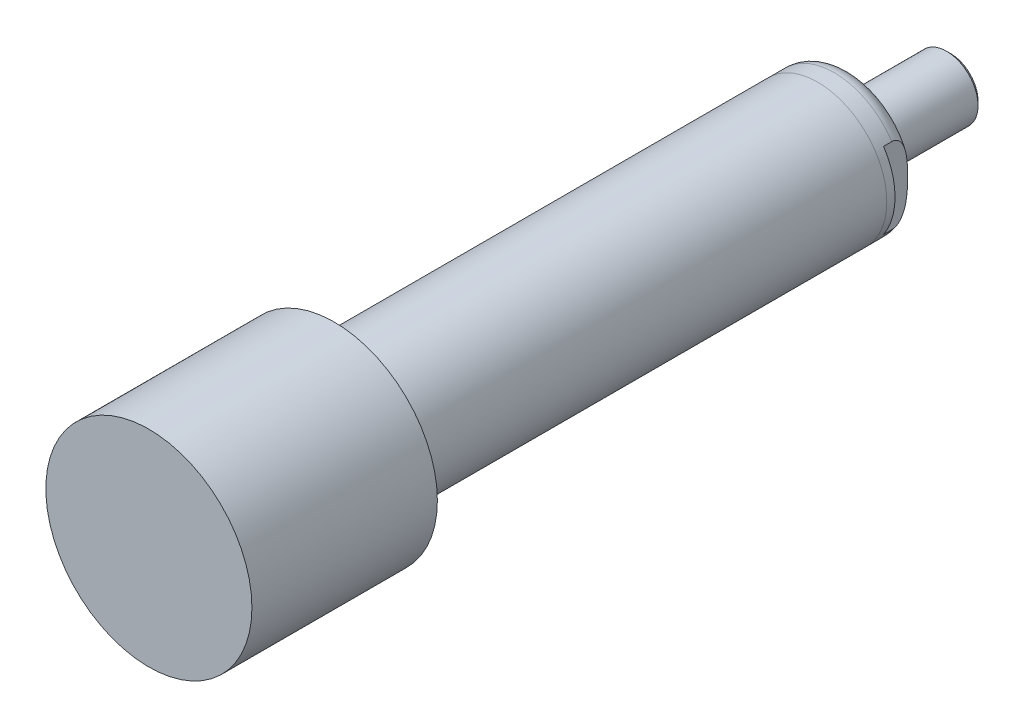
ISO-10303-21;
HEADER;
FILE_DESCRIPTION(('STEP AP214'),'2;1');
FILE_NAME('part.step','',(''),(''),'','','');
FILE_SCHEMA(('AUTOMOTIVE_DESIGN { 1 0 10303 214 1 1 1 1 }'));
ENDSEC;
DATA;
#1=APPLICATION_CONTEXT('core data for automotive mechanical design processes');
#2=APPLICATION_PROTOCOL_DEFINITION('international standard','automotive_design',2000,#1);
#3=PRODUCT_CONTEXT('',#1,'mechanical');
#4=PRODUCT('Part','Part','',(#3));
#5=PRODUCT_RELATED_PRODUCT_CATEGORY('part','',(#4));
#6=PRODUCT_DEFINITION_FORMATION('','',#4);
#7=PRODUCT_DEFINITION_CONTEXT('part definition',#1,'design');
#8=PRODUCT_DEFINITION('design','',#6,#7);
#9=PRODUCT_DEFINITION_SHAPE('','',#8);
#10=(LENGTH_UNIT() NAMED_UNIT(*) SI_UNIT(.MILLI.,.METRE.));
#11=(NAMED_UNIT(*) PLANE_ANGLE_UNIT() SI_UNIT($,.RADIAN.));
#12=(NAMED_UNIT(*) SI_UNIT($,.STERADIAN.) SOLID_ANGLE_UNIT());
#13=UNCERTAINTY_MEASURE_WITH_UNIT(LENGTH_MEASURE(1.E-05),#10,'distance_accuracy_value','');
#14=(GEOMETRIC_REPRESENTATION_CONTEXT(3) GLOBAL_UNCERTAINTY_ASSIGNED_CONTEXT((#13)) GLOBAL_UNIT_ASSIGNED_CONTEXT((#10,
#11,#12)) REPRESENTATION_CONTEXT('',''));
#15=CARTESIAN_POINT('',(0.,0.,0.));
#16=DIRECTION('',(0.,0.,1.));
#17=DIRECTION('',(1.,0.,0.));
#18=AXIS2_PLACEMENT_3D('',#15,#16,#17);
#19=CARTESIAN_POINT('',(0.,0.,12.7));
#20=DIRECTION('',(0.,0.,-1.));
#21=DIRECTION('',(-1.,0.,0.));
#22=AXIS2_PLACEMENT_3D('',#19,#20,#21);
#23=CYLINDRICAL_SURFACE('',#22,13.2);
#24=CARTESIAN_POINT('',(0.,0.,12.7));
#25=DIRECTION('',(0.,0.,1.));
#26=DIRECTION('',(1.,0.,0.));
#27=AXIS2_PLACEMENT_3D('',#24,#25,#26);
#28=CIRCLE('',#27,13.2);
#29=CARTESIAN_POINT('',(13.2,0.,12.7));
#30=VERTEX_POINT('',#29);
#31=EDGE_CURVE('E30',#30,#30,#28,.T.);
#32=ORIENTED_EDGE('',*,*,#31,.F.);
#33=EDGE_LOOP('',(#32));
#34=FACE_BOUND('',#33,.T.);
#35=CARTESIAN_POINT('',(0.,0.,-79.6352000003));
#36=DIRECTION('',(0.,0.,1.));
#37=DIRECTION('',(1.,0.,0.));
#38=AXIS2_PLACEMENT_3D('',#35,#36,#37);
#39=CIRCLE('',#38,13.2);
#40=CARTESIAN_POINT('',(13.2,0.,-79.6352000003));
#41=VERTEX_POINT('',#40);
#42=EDGE_CURVE('E197',#41,#41,#39,.T.);
#43=ORIENTED_EDGE('',*,*,#42,.T.);
#44=EDGE_LOOP('',(#43));
#45=FACE_BOUND('',#44,.T.);
#46=ADVANCED_FACE('F16',(#34,#45),#23,.T.);
#47=CARTESIAN_POINT('',(0.,0.,-79.6352000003));
#48=DIRECTION('',(0.,0.,1.));
#49=DIRECTION('',(1.,0.,0.));
#50=AXIS2_PLACEMENT_3D('',#47,#48,#49);
#51=PLANE('',#50);
#52=CARTESIAN_POINT('',(0.,0.,-79.6352000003));
#53=DIRECTION('',(0.,0.,1.));
#54=DIRECTION('',(1.,0.,0.));
#55=AXIS2_PLACEMENT_3D('',#52,#53,#54);
#56=CIRCLE('',#55,13.1953);
#57=CARTESIAN_POINT('',(13.1953,0.,-79.6352000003));
#58=VERTEX_POINT('',#57);
#59=EDGE_CURVE('E10',#58,#58,#56,.T.);
#60=ORIENTED_EDGE('',*,*,#59,.T.);
#61=EDGE_LOOP('',(#60));
#62=FACE_BOUND('',#61,.T.);
#63=ORIENTED_EDGE('',*,*,#42,.F.);
#64=EDGE_LOOP('',(#63));
#65=FACE_BOUND('',#64,.T.);
#66=ADVANCED_FACE('F129',(#62,#65),#51,.F.);
#67=CARTESIAN_POINT('',(0.,6.,-105.0352000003));
#68=DIRECTION('',(0.,0.,-1.));
#69=DIRECTION('',(-1.,0.,0.));
#70=AXIS2_PLACEMENT_3D('',#67,#68,#69);
#71=PLANE('',#70);
#72=CARTESIAN_POINT('',(0.,0.,-105.0352000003));
#73=DIRECTION('',(0.,0.,-1.));
#74=DIRECTION('',(-1.,0.,0.));
#75=AXIS2_PLACEMENT_3D('',#72,#73,#74);
#76=CIRCLE('',#75,5.238);
#77=CARTESIAN_POINT('',(-5.238,0.,-105.0352000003));
#78=VERTEX_POINT('',#77);
#79=EDGE_CURVE('E107',#78,#78,#76,.T.);
#80=ORIENTED_EDGE('',*,*,#79,.T.);
#81=EDGE_LOOP('',(#80));
#82=FACE_BOUND('',#81,.T.);
#83=ADVANCED_FACE('F126',(#82),#71,.T.);
#84=CARTESIAN_POINT('',(0.,0.,-105.0352000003));
#85=DIRECTION('',(0.,0.,1.));
#86=DIRECTION('',(1.,0.,0.));
#87=AXIS2_PLACEMENT_3D('',#84,#85,#86);
#88=CONICAL_SURFACE('',#87,5.238,0.785398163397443);
#89=CARTESIAN_POINT('',(0.,0.,-104.2732000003));
#90=DIRECTION('',(0.,0.,-1.));
#91=DIRECTION('',(-1.,0.,0.));
#92=AXIS2_PLACEMENT_3D('',#89,#90,#91);
#93=CIRCLE('',#92,6.);
#94=CARTESIAN_POINT('',(-6.,0.,-104.2732000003));
#95=VERTEX_POINT('',#94);
#96=EDGE_CURVE('E110',#95,#95,#93,.F.);
#97=ORIENTED_EDGE('',*,*,#96,.F.);
#98=EDGE_LOOP('',(#97));
#99=FACE_BOUND('',#98,.T.);
#100=ORIENTED_EDGE('',*,*,#79,.F.);
#101=EDGE_LOOP('',(#100));
#102=FACE_BOUND('',#101,.T.);
#103=ADVANCED_FACE('F18',(#99,#102),#88,.T.);
#104=CARTESIAN_POINT('',(0.,0.,-105.0352000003));
#105=DIRECTION('',(0.,0.,-1.));
#106=DIRECTION('',(-1.,0.,0.));
#107=AXIS2_PLACEMENT_3D('',#104,#105,#106);
#108=CYLINDRICAL_SURFACE('',#107,6.);
#109=ORIENTED_EDGE('',*,*,#96,.T.);
#110=EDGE_LOOP('',(#109));
#111=FACE_BOUND('',#110,.T.);
#112=CARTESIAN_POINT('',(0.,0.,-88.7792000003));
#113=DIRECTION('',(0.,0.,-1.));
#114=DIRECTION('',(-1.,0.,0.));
#115=AXIS2_PLACEMENT_3D('',#112,#113,#114);
#116=CIRCLE('',#115,6.);
#117=CARTESIAN_POINT('',(-6.,0.,-88.7792000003));
#118=VERTEX_POINT('',#117);
#119=EDGE_CURVE('E83',#118,#118,#116,.T.);
#120=ORIENTED_EDGE('',*,*,#119,.T.);
#121=EDGE_LOOP('',(#120));
#122=FACE_BOUND('',#121,.T.);
#123=ADVANCED_FACE('F131',(#111,#122),#108,.T.);
#124=CARTESIAN_POINT('',(0.,4.6736,-88.7792000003));
#125=DIRECTION('',(0.,0.,1.));
#126=DIRECTION('',(1.,0.,0.));
#127=AXIS2_PLACEMENT_3D('',#124,#125,#126);
#128=PLANE('',#127);
#129=CARTESIAN_POINT('',(0.,0.,-88.7792000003));
#130=DIRECTION('',(0.,0.,-1.));
#131=DIRECTION('',(-1.,0.,0.));
#132=AXIS2_PLACEMENT_3D('',#129,#130,#131);
#133=CIRCLE('',#132,4.6736);
#134=CARTESIAN_POINT('',(-4.6736,0.,-88.7792000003));
#135=VERTEX_POINT('',#134);
#136=EDGE_CURVE('E95',#135,#135,#133,.T.);
#137=ORIENTED_EDGE('',*,*,#136,.T.);
#138=EDGE_LOOP('',(#137));
#139=FACE_BOUND('',#138,.T.);
#140=ORIENTED_EDGE('',*,*,#119,.F.);
#141=EDGE_LOOP('',(#140));
#142=FACE_BOUND('',#141,.T.);
#143=ADVANCED_FACE('F134',(#139,#142),#128,.T.);
#144=CARTESIAN_POINT('',(0.,0.,-105.0352000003));
#145=DIRECTION('',(0.,0.,-1.));
#146=DIRECTION('',(-1.,0.,0.));
#147=AXIS2_PLACEMENT_3D('',#144,#145,#146);
#148=CYLINDRICAL_SURFACE('',#147,4.6736);
#149=CARTESIAN_POINT('',(0.,0.,-85.9852000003));
#150=DIRECTION('',(0.,0.,-1.));
#151=DIRECTION('',(-1.,0.,0.));
#152=AXIS2_PLACEMENT_3D('',#149,#150,#151);
#153=CIRCLE('',#152,4.6736);
#154=CARTESIAN_POINT('',(-4.6736,0.,-85.9852000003));
#155=VERTEX_POINT('',#154);
#156=EDGE_CURVE('E98',#155,#155,#153,.T.);
#157=ORIENTED_EDGE('',*,*,#156,.T.);
#158=EDGE_LOOP('',(#157));
#159=FACE_BOUND('',#158,.T.);
#160=ORIENTED_EDGE('',*,*,#136,.F.);
#161=EDGE_LOOP('',(#160));
#162=FACE_BOUND('',#161,.T.);
#163=ADVANCED_FACE('F138',(#159,#162),#148,.T.);
#164=CARTESIAN_POINT('',(0.,10.0203,-85.9852000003));
#165=DIRECTION('',(0.,0.,-1.));
#166=DIRECTION('',(-1.,0.,0.));
#167=AXIS2_PLACEMENT_3D('',#164,#165,#166);
#168=PLANE('',#167);
#169=CARTESIAN_POINT('',(0.,0.,-85.9852000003));
#170=DIRECTION('',(0.,0.,-1.));
#171=DIRECTION('',(-1.,0.,0.));
#172=AXIS2_PLACEMENT_3D('',#169,#170,#171);
#173=CIRCLE('',#172,10.0203);
#174=CARTESIAN_POINT('',(-10.0203,0.,-85.9852000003));
#175=VERTEX_POINT('',#174);
#176=EDGE_CURVE('E101',#175,#175,#173,.T.);
#177=ORIENTED_EDGE('',*,*,#176,.T.);
#178=EDGE_LOOP('',(#177));
#179=FACE_BOUND('',#178,.T.);
#180=ORIENTED_EDGE('',*,*,#156,.F.);
#181=EDGE_LOOP('',(#180));
#182=FACE_BOUND('',#181,.T.);
#183=ADVANCED_FACE('F141',(#179,#182),#168,.T.);
#184=CARTESIAN_POINT('',(0.,0.,-81.2227000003));
#185=DIRECTION('',(0.,0.,-1.));
#186=DIRECTION('',(0.,1.,0.));
#187=AXIS2_PLACEMENT_3D('',#184,#185,#186);
#188=PLANE('',#187);
#189=CARTESIAN_POINT('',(0.,0.,-81.2227000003));
#190=DIRECTION('',(0.,0.,-1.));
#191=DIRECTION('',(0.,1.,0.));
#192=AXIS2_PLACEMENT_3D('',#189,#190,#191);
#193=CIRCLE('',#192,13.1953);
#194=CARTESIAN_POINT('',(11.,7.28806847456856,-81.2227000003));
#195=VERTEX_POINT('',#194);
#196=CARTESIAN_POINT('',(11.,-7.28806847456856,-81.2227000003));
#197=VERTEX_POINT('',#196);
#198=EDGE_CURVE('E66',#195,#197,#193,.T.);
#199=ORIENTED_EDGE('',*,*,#198,.T.);
#200=DIRECTION('',(0.,1.,0.));
#201=VECTOR('',#200,1.);
#202=CARTESIAN_POINT('',(11.,-7.28806847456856,-81.2227000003));
#203=LINE('',#202,#201);
#204=EDGE_CURVE('E68',#197,#195,#203,.T.);
#205=ORIENTED_EDGE('',*,*,#204,.T.);
#206=EDGE_LOOP('',(#199,#205));
#207=FACE_BOUND('',#206,.T.);
#208=ADVANCED_FACE('F67',(#207),#188,.T.);
#209=CARTESIAN_POINT('',(0.,0.,-81.2227000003));
#210=DIRECTION('',(0.,0.,-1.));
#211=DIRECTION('',(0.,1.,0.));
#212=AXIS2_PLACEMENT_3D('',#209,#210,#211);
#213=PLANE('',#212);
#214=CARTESIAN_POINT('',(0.,0.,-81.2227000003));
#215=DIRECTION('',(0.,0.,-1.));
#216=DIRECTION('',(0.,1.,0.));
#217=AXIS2_PLACEMENT_3D('',#214,#215,#216);
#218=CIRCLE('',#217,13.1953);
#219=CARTESIAN_POINT('',(-11.,-7.28806847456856,-81.2227000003));
#220=VERTEX_POINT('',#219);
#221=CARTESIAN_POINT('',(-11.,7.28806847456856,-81.2227000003));
#222=VERTEX_POINT('',#221);
#223=EDGE_CURVE('E86',#220,#222,#218,.T.);
#224=ORIENTED_EDGE('',*,*,#223,.T.);
#225=DIRECTION('',(0.,-1.,0.));
#226=VECTOR('',#225,1.);
#227=CARTESIAN_POINT('',(-11.,-7.28806847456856,-81.2227000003));
#228=LINE('',#227,#226);
#229=EDGE_CURVE('E88',#222,#220,#228,.T.);
#230=ORIENTED_EDGE('',*,*,#229,.T.);
#231=EDGE_LOOP('',(#224,#230));
#232=FACE_BOUND('',#231,.T.);
#233=ADVANCED_FACE('F125',(#232),#213,.T.);
#234=CARTESIAN_POINT('',(-11.,-7.28806847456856,-81.2227000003));
#235=DIRECTION('',(1.,0.,0.));
#236=DIRECTION('',(0.,0.,-1.));
#237=AXIS2_PLACEMENT_3D('',#234,#235,#236);
#238=PLANE('',#237);
#239=CARTESIAN_POINT('',(-11.,0.,-85.8302683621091));
#240=CARTESIAN_POINT('',(-11.,-0.283999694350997,-85.8302768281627));
#241=CARTESIAN_POINT('',(-11.,-0.568005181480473,-85.8267628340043));
#242=CARTESIAN_POINT('',(-11.,-1.13588950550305,-85.8120026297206));
#243=CARTESIAN_POINT('',(-11.,-1.41976830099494,-85.8007547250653));
#244=CARTESIAN_POINT('',(-11.,-1.98660637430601,-85.7683601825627));
#245=CARTESIAN_POINT('',(-11.,-2.2695663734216,-85.7472267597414));
#246=CARTESIAN_POINT('',(-11.,-2.83413520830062,-85.6914556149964));
#247=CARTESIAN_POINT('',(-11.,-3.11574456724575,-85.6568236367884));
#248=CARTESIAN_POINT('',(-11.,-3.55465920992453,-85.5878840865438));
#249=CARTESIAN_POINT('',(-11.,-3.71295758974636,-85.5599370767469));
#250=CARTESIAN_POINT('',(-11.,-4.02809043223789,-85.4968007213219));
#251=CARTESIAN_POINT('',(-11.,-4.18492521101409,-85.46161297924));
#252=CARTESIAN_POINT('',(-11.,-4.49637441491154,-85.3826027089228));
#253=CARTESIAN_POINT('',(-11.,-4.65098969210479,-85.3387835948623));
#254=CARTESIAN_POINT('',(-11.,-4.95689533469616,-85.2408738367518));
#255=CARTESIAN_POINT('',(-11.,-5.10818706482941,-85.186787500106));
#256=CARTESIAN_POINT('',(-11.,-5.45074925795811,-85.0483399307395));
#257=CARTESIAN_POINT('',(-11.,-5.64036341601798,-84.9597654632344));
#258=CARTESIAN_POINT('',(-11.,-6.00572300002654,-84.7572899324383));
#259=CARTESIAN_POINT('',(-11.,-6.1814901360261,-84.6434296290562));
#260=CARTESIAN_POINT('',(-11.,-6.45820918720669,-84.4260916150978));
#261=CARTESIAN_POINT('',(-11.,-6.56534232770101,-84.3305469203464));
#262=CARTESIAN_POINT('',(-11.,-6.76389982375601,-84.1242350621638));
#263=CARTESIAN_POINT('',(-11.,-6.85534714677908,-84.0134905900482));
#264=CARTESIAN_POINT('',(-11.,-6.99925203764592,-83.8024290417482));
#265=CARTESIAN_POINT('',(-11.,-7.0558654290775,-83.7049649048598));
#266=CARTESIAN_POINT('',(-11.,-7.15237368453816,-83.5020196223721));
#267=CARTESIAN_POINT('',(-11.,-7.19227985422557,-83.396543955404));
#268=CARTESIAN_POINT('',(-11.,-7.25258182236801,-83.1792185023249));
#269=CARTESIAN_POINT('',(-11.,-7.27283171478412,-83.0673274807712));
#270=CARTESIAN_POINT('',(-11.,-7.29141605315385,-82.8417418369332));
#271=CARTESIAN_POINT('',(-11.,-7.28976069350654,-82.7280480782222));
#272=CARTESIAN_POINT('',(-11.,-7.26620536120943,-82.5162384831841));
#273=CARTESIAN_POINT('',(-11.,-7.24667907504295,-82.4178470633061));
#274=CARTESIAN_POINT('',(-11.,-7.19210149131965,-82.2255139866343));
#275=CARTESIAN_POINT('',(-11.,-7.15704664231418,-82.1315733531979));
#276=CARTESIAN_POINT('',(-11.,-7.06159341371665,-81.9240456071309));
#277=CARTESIAN_POINT('',(-11.,-6.9968217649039,-81.8124750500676));
#278=CARTESIAN_POINT('',(-11.,-6.84998946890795,-81.6013530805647));
#279=CARTESIAN_POINT('',(-11.,-6.76789440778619,-81.5018262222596));
#280=CARTESIAN_POINT('',(-11.,-6.55146033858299,-81.2735251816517));
#281=CARTESIAN_POINT('',(-11.,-6.41012375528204,-81.1514279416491));
#282=CARTESIAN_POINT('',(-11.,-6.11056852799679,-80.9305852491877));
#283=CARTESIAN_POINT('',(-11.,-5.9523292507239,-80.8318688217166));
#284=CARTESIAN_POINT('',(-11.,-5.64572522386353,-80.6654163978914));
#285=CARTESIAN_POINT('',(-11.,-5.49859707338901,-80.5953506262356));
#286=CARTESIAN_POINT('',(-11.,-5.19879419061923,-80.4681166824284));
#287=CARTESIAN_POINT('',(-11.,-5.04611483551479,-80.4109595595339));
#288=CARTESIAN_POINT('',(-11.,-4.73651269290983,-80.3073661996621));
#289=CARTESIAN_POINT('',(-11.,-4.57957488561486,-80.2609755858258));
#290=CARTESIAN_POINT('',(-11.,-4.26338013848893,-80.177457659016));
#291=CARTESIAN_POINT('',(-11.,-4.10412450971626,-80.1403253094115));
#292=CARTESIAN_POINT('',(-11.,-3.80528382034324,-80.0781849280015));
#293=CARTESIAN_POINT('',(-11.,-3.66589375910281,-80.0522217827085));
#294=CARTESIAN_POINT('',(-11.,-3.38627572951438,-80.0052417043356));
#295=CARTESIAN_POINT('',(-11.,-3.2460476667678,-79.9842253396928));
#296=CARTESIAN_POINT('',(-11.,-2.82435930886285,-79.927438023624));
#297=CARTESIAN_POINT('',(-11.,-2.54205294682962,-79.8979598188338));
#298=CARTESIAN_POINT('',(-11.,-1.97560851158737,-79.8510210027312));
#299=CARTESIAN_POINT('',(-11.,-1.6914674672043,-79.8335995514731));
#300=CARTESIAN_POINT('',(-11.,-1.12288122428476,-79.8077922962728));
#301=CARTESIAN_POINT('',(-11.,-0.838436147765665,-79.7994036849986));
#302=CARTESIAN_POINT('',(-11.,-0.268305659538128,-79.7899553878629));
#303=CARTESIAN_POINT('',(-11.,0.017380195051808,-79.7889249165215));
#304=CARTESIAN_POINT('',(-11.,0.588744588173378,-79.7940528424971));
#305=CARTESIAN_POINT('',(-11.,0.87442311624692,-79.8002125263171));
#306=CARTESIAN_POINT('',(-11.,1.44479398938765,-79.8209657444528));
#307=CARTESIAN_POINT('',(-11.,1.72948704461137,-79.835538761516));
#308=CARTESIAN_POINT('',(-11.,2.29804894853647,-79.8758196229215));
#309=CARTESIAN_POINT('',(-11.,2.58191804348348,-79.901523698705));
#310=CARTESIAN_POINT('',(-11.,3.0694765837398,-79.9590896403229));
#311=CARTESIAN_POINT('',(-11.,3.27359191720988,-79.9872727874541));
#312=CARTESIAN_POINT('',(-11.,3.68030619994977,-80.0538869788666));
#313=CARTESIAN_POINT('',(-11.,3.88290424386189,-80.0923237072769));
#314=CARTESIAN_POINT('',(-11.,4.28378522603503,-80.1817641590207));
#315=CARTESIAN_POINT('',(-11.,4.48208907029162,-80.2326720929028));
#316=CARTESIAN_POINT('',(-11.,4.87385387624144,-80.3503449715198));
#317=CARTESIAN_POINT('',(-11.,5.06731944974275,-80.4170941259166));
#318=CARTESIAN_POINT('',(-11.,5.42309726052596,-80.5608858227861));
#319=CARTESIAN_POINT('',(-11.,5.58631452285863,-80.6356526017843));
#320=CARTESIAN_POINT('',(-11.,5.90375766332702,-80.8036130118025));
#321=CARTESIAN_POINT('',(-11.,6.05795849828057,-80.8968550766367));
#322=CARTESIAN_POINT('',(-11.,6.35347249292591,-81.1061808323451));
#323=CARTESIAN_POINT('',(-11.,6.49458439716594,-81.2225549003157));
#324=CARTESIAN_POINT('',(-11.,6.75236292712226,-81.4797207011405));
#325=CARTESIAN_POINT('',(-11.,6.86913495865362,-81.6204021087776));
#326=CARTESIAN_POINT('',(-11.,7.02685937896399,-81.8645230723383));
#327=CARTESIAN_POINT('',(-11.,7.07947573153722,-81.9604348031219));
#328=CARTESIAN_POINT('',(-11.,7.16853265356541,-82.1595648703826));
#329=CARTESIAN_POINT('',(-11.,7.20498337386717,-82.2627785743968));
#330=CARTESIAN_POINT('',(-11.,7.25920110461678,-82.4747921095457));
#331=CARTESIAN_POINT('',(-11.,7.27684597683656,-82.5836237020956));
#332=CARTESIAN_POINT('',(-11.,7.29147337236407,-82.8026657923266));
#333=CARTESIAN_POINT('',(-11.,7.28846304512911,-82.9128757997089));
#334=CARTESIAN_POINT('',(-11.,7.26329711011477,-83.120810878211));
#335=CARTESIAN_POINT('',(-11.,7.24291275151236,-83.2187578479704));
#336=CARTESIAN_POINT('',(-11.,7.18679789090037,-83.4101145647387));
#337=CARTESIAN_POINT('',(-11.,7.15106215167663,-83.5035227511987));
#338=CARTESIAN_POINT('',(-11.,7.05375831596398,-83.7108775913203));
#339=CARTESIAN_POINT('',(-11.,6.98767220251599,-83.8226996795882));
#340=CARTESIAN_POINT('',(-11.,6.83821910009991,-84.0340962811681));
#341=CARTESIAN_POINT('',(-11.,6.75482099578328,-84.1336482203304));
#342=CARTESIAN_POINT('',(-11.,6.53478721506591,-84.3623246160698));
#343=CARTESIAN_POINT('',(-11.,6.39108122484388,-84.4846016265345));
#344=CARTESIAN_POINT('',(-11.,6.08671299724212,-84.7055608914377));
#345=CARTESIAN_POINT('',(-11.,5.92601813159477,-84.8041965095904));
#346=CARTESIAN_POINT('',(-11.,5.61399295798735,-84.9707503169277));
#347=CARTESIAN_POINT('',(-11.,5.46384379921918,-85.0409320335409));
#348=CARTESIAN_POINT('',(-11.,5.15800379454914,-85.168138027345));
#349=CARTESIAN_POINT('',(-11.,5.002308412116,-85.2251512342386));
#350=CARTESIAN_POINT('',(-11.,4.68703415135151,-85.3281648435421));
#351=CARTESIAN_POINT('',(-11.,4.52744819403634,-85.3741432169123));
#352=CARTESIAN_POINT('',(-11.,4.20585528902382,-85.4567938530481));
#353=CARTESIAN_POINT('',(-11.,4.04384743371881,-85.493462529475));
#354=CARTESIAN_POINT('',(-11.,3.72194157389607,-85.5583030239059));
#355=CARTESIAN_POINT('',(-11.,3.56207763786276,-85.5866468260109));
#356=CARTESIAN_POINT('',(-11.,3.24141366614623,-85.6371546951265));
#357=CARTESIAN_POINT('',(-11.,3.08061376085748,-85.6593196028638));
#358=CARTESIAN_POINT('',(-11.,2.75826796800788,-85.6985369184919));
#359=CARTESIAN_POINT('',(-11.,2.59672157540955,-85.7155851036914));
#360=CARTESIAN_POINT('',(-11.,2.27322894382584,-85.7454157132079));
#361=CARTESIAN_POINT('',(-11.,2.11128267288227,-85.7581977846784));
#362=CARTESIAN_POINT('',(-11.,1.78700791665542,-85.7802079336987));
#363=CARTESIAN_POINT('',(-11.,1.62467921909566,-85.7894328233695));
#364=CARTESIAN_POINT('',(-11.,1.29988702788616,-85.8048571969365));
#365=CARTESIAN_POINT('',(-11.,1.13742353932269,-85.8110567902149));
#366=CARTESIAN_POINT('',(-11.,0.812483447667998,-85.8208192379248));
#367=CARTESIAN_POINT('',(-11.,0.650006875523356,-85.824383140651));
#368=CARTESIAN_POINT('',(-11.,0.325020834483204,-85.8291052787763));
#369=CARTESIAN_POINT('',(-11.,0.162511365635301,-85.8302635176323));
#370=CARTESIAN_POINT('',(-11.,0.,-85.8302683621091));
#371=B_SPLINE_CURVE_WITH_KNOTS('',3,(#239,#240,#241,#242,#243,#244,#245,#246,#247,#248,#249,
#250,#251,#252,#253,#254,#255,#256,#257,#258,#259,#260,#261,#262,#263,#264,#265,#266,#267,#268,
#269,#270,#271,#272,#273,#274,#275,#276,#277,#278,#279,#280,#281,#282,#283,#284,#285,#286,#287,
#288,#289,#290,#291,#292,#293,#294,#295,#296,#297,#298,#299,#300,#301,#302,#303,#304,#305,#306,
#307,#308,#309,#310,#311,#312,#313,#314,#315,#316,#317,#318,#319,#320,#321,#322,#323,#324,#325,
#326,#327,#328,#329,#330,#331,#332,#333,#334,#335,#336,#337,#338,#339,#340,#341,#342,#343,#344,
#345,#346,#347,#348,#349,#350,#351,#352,#353,#354,#355,#356,#357,#358,#359,#360,#361,#362,#363,
#364,#365,#366,#367,#368,#369,#370),.UNSPECIFIED.,.T.,.F.,(4,2,2,2,2,2,2,2,2,2,2,2,2,2,2,2,2,2,
2,2,2,2,2,2,2,2,2,2,2,2,2,2,2,2,2,2,2,2,2,2,2,2,2,2,2,2,2,2,2,2,2,2,2,2,2,2,2,2,2,2,2,2,2,2,2,
4),(0.,0.851985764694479,1.70415826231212,2.55519481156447,3.40586963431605,3.88797536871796,
4.36997444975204,4.851783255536,5.33339037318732,5.9597982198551,6.58520355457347,
7.0145698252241,7.44330194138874,7.78013770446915,8.11674516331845,8.45583253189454,
8.79476209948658,9.09432594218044,9.39395833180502,9.77885740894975,10.164528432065,
10.7217137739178,11.2795872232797,11.7677560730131,12.256341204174,12.7469603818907,
13.2373120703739,13.6625744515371,14.0878856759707,14.9389905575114,15.7928469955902,
16.6464379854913,17.5034161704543,18.3605477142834,19.2155977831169,20.0703585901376,
20.6883186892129,21.3066220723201,21.9203175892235,22.5334039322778,23.0710845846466,
23.6101938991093,24.1565548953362,24.7004982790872,25.0274756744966,25.3542474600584,
25.6831288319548,26.0118963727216,26.3106776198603,26.6095608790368,26.9970844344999,
27.3853106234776,27.9482115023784,28.5122138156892,29.008712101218,29.5056262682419,
30.0035243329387,30.5016139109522,30.9885424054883,31.4754046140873,31.9626675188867,
32.4499707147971,32.9377096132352,33.4254308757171,33.9129580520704,34.4004845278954),.UNSPECIFIED.);
#372=CARTESIAN_POINT('',(-11.,7.28806847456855,-82.8102000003));
#373=VERTEX_POINT('',#372);
#374=CARTESIAN_POINT('',(-11.,-7.28806847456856,-82.8102000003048));
#375=VERTEX_POINT('',#374);
#376=EDGE_CURVE('E112',#373,#375,#371,.T.);
#377=ORIENTED_EDGE('',*,*,#376,.T.);
#378=DIRECTION('',(0.,0.,-1.));
#379=VECTOR('',#378,1.);
#380=CARTESIAN_POINT('',(-11.,-7.28806847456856,-81.2227000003));
#381=LINE('',#380,#379);
#382=EDGE_CURVE('E71',#220,#375,#381,.T.);
#383=ORIENTED_EDGE('',*,*,#382,.F.);
#384=ORIENTED_EDGE('',*,*,#229,.F.);
#385=DIRECTION('',(0.,0.,-1.));
#386=VECTOR('',#385,1.);
#387=CARTESIAN_POINT('',(-11.,7.28806847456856,-81.2227000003));
#388=LINE('',#387,#386);
#389=EDGE_CURVE('E46',#222,#373,#388,.T.);
#390=ORIENTED_EDGE('',*,*,#389,.T.);
#391=EDGE_LOOP('',(#377,#383,#384,#390));
#392=FACE_BOUND('',#391,.T.);
#393=ADVANCED_FACE('F120',(#392),#238,.F.);
#394=CARTESIAN_POINT('',(0.,0.,-82.8102000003));
#395=DIRECTION('',(0.,0.,-1.));
#396=DIRECTION('',(-1.,0.,0.));
#397=AXIS2_PLACEMENT_3D('',#394,#395,#396);
#398=TOROIDAL_SURFACE('',#397,10.0203,3.175);
#399=CARTESIAN_POINT('',(11.,0.,-85.8302683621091));
#400=CARTESIAN_POINT('',(11.,0.283999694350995,-85.8302768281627));
#401=CARTESIAN_POINT('',(11.,0.568005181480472,-85.8267628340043));
#402=CARTESIAN_POINT('',(11.,1.13588950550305,-85.8120026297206));
#403=CARTESIAN_POINT('',(11.,1.41976830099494,-85.8007547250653));
#404=CARTESIAN_POINT('',(11.,1.98660637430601,-85.7683601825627));
#405=CARTESIAN_POINT('',(11.,2.2695663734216,-85.7472267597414));
#406=CARTESIAN_POINT('',(11.,2.83413520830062,-85.6914556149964));
#407=CARTESIAN_POINT('',(11.,3.11574456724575,-85.6568236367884));
#408=CARTESIAN_POINT('',(11.,3.55465920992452,-85.5878840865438));
#409=CARTESIAN_POINT('',(11.,3.71295758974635,-85.5599370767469));
#410=CARTESIAN_POINT('',(11.,4.02809043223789,-85.4968007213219));
#411=CARTESIAN_POINT('',(11.,4.18492521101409,-85.46161297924));
#412=CARTESIAN_POINT('',(11.,4.49637441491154,-85.3826027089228));
#413=CARTESIAN_POINT('',(11.,4.6509896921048,-85.3387835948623));
#414=CARTESIAN_POINT('',(11.,4.95689533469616,-85.2408738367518));
#415=CARTESIAN_POINT('',(11.,5.10818706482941,-85.186787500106));
#416=CARTESIAN_POINT('',(11.,5.45074925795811,-85.0483399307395));
#417=CARTESIAN_POINT('',(11.,5.64036341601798,-84.9597654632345));
#418=CARTESIAN_POINT('',(11.,6.00572300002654,-84.7572899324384));
#419=CARTESIAN_POINT('',(11.,6.18149013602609,-84.6434296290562));
#420=CARTESIAN_POINT('',(11.,6.45820918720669,-84.4260916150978));
#421=CARTESIAN_POINT('',(11.,6.56534232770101,-84.3305469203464));
#422=CARTESIAN_POINT('',(11.,6.763899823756,-84.1242350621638));
#423=CARTESIAN_POINT('',(11.,6.85534714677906,-84.0134905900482));
#424=CARTESIAN_POINT('',(11.,6.99925203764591,-83.8024290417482));
#425=CARTESIAN_POINT('',(11.,7.0558654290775,-83.7049649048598));
#426=CARTESIAN_POINT('',(11.,7.15237368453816,-83.5020196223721));
#427=CARTESIAN_POINT('',(11.,7.19227985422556,-83.396543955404));
#428=CARTESIAN_POINT('',(11.,7.252581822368,-83.1792185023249));
#429=CARTESIAN_POINT('',(11.,7.27283171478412,-83.0673274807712));
#430=CARTESIAN_POINT('',(11.,7.29141605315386,-82.8417418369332));
#431=CARTESIAN_POINT('',(11.,7.28976069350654,-82.7280480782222));
#432=CARTESIAN_POINT('',(11.,7.26620536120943,-82.5162384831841));
#433=CARTESIAN_POINT('',(11.,7.24667907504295,-82.4178470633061));
#434=CARTESIAN_POINT('',(11.,7.19210149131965,-82.2255139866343));
#435=CARTESIAN_POINT('',(11.,7.15704664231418,-82.1315733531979));
#436=CARTESIAN_POINT('',(11.,7.06159341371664,-81.9240456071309));
#437=CARTESIAN_POINT('',(11.,6.9968217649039,-81.8124750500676));
#438=CARTESIAN_POINT('',(11.,6.84998946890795,-81.6013530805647));
#439=CARTESIAN_POINT('',(11.,6.76789440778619,-81.5018262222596));
#440=CARTESIAN_POINT('',(11.,6.55146033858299,-81.2735251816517));
#441=CARTESIAN_POINT('',(11.,6.41012375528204,-81.1514279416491));
#442=CARTESIAN_POINT('',(11.,6.11056852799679,-80.9305852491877));
#443=CARTESIAN_POINT('',(11.,5.9523292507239,-80.8318688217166));
#444=CARTESIAN_POINT('',(11.,5.64572522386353,-80.6654163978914));
#445=CARTESIAN_POINT('',(11.,5.49859707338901,-80.5953506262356));
#446=CARTESIAN_POINT('',(11.,5.19879419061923,-80.4681166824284));
#447=CARTESIAN_POINT('',(11.,5.0461148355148,-80.4109595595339));
#448=CARTESIAN_POINT('',(11.,4.73651269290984,-80.3073661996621));
#449=CARTESIAN_POINT('',(11.,4.57957488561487,-80.2609755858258));
#450=CARTESIAN_POINT('',(11.,4.26338013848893,-80.177457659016));
#451=CARTESIAN_POINT('',(11.,4.10412450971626,-80.1403253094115));
#452=CARTESIAN_POINT('',(11.,3.80528382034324,-80.0781849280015));
#453=CARTESIAN_POINT('',(11.,3.66589375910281,-80.0522217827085));
#454=CARTESIAN_POINT('',(11.,3.38627572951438,-80.0052417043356));
#455=CARTESIAN_POINT('',(11.,3.2460476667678,-79.9842253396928));
#456=CARTESIAN_POINT('',(11.,2.82435930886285,-79.927438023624));
#457=CARTESIAN_POINT('',(11.,2.54205294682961,-79.8979598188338));
#458=CARTESIAN_POINT('',(11.,1.97560851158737,-79.8510210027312));
#459=CARTESIAN_POINT('',(11.,1.6914674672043,-79.8335995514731));
#460=CARTESIAN_POINT('',(11.,1.12288122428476,-79.8077922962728));
#461=CARTESIAN_POINT('',(11.,0.838436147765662,-79.7994036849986));
#462=CARTESIAN_POINT('',(11.,0.268305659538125,-79.7899553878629));
#463=CARTESIAN_POINT('',(11.,-0.0173801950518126,-79.7889249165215));
#464=CARTESIAN_POINT('',(11.,-0.588744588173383,-79.7940528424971));
#465=CARTESIAN_POINT('',(11.,-0.874423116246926,-79.8002125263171));
#466=CARTESIAN_POINT('',(11.,-1.44479398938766,-79.8209657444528));
#467=CARTESIAN_POINT('',(11.,-1.72948704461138,-79.835538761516));
#468=CARTESIAN_POINT('',(11.,-2.29804894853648,-79.8758196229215));
#469=CARTESIAN_POINT('',(11.,-2.58191804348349,-79.901523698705));
#470=CARTESIAN_POINT('',(11.,-3.06947658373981,-79.9590896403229));
#471=CARTESIAN_POINT('',(11.,-3.27359191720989,-79.9872727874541));
#472=CARTESIAN_POINT('',(11.,-3.68030619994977,-80.0538869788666));
#473=CARTESIAN_POINT('',(11.,-3.88290424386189,-80.092323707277));
#474=CARTESIAN_POINT('',(11.,-4.28378522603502,-80.1817641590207));
#475=CARTESIAN_POINT('',(11.,-4.48208907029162,-80.2326720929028));
#476=CARTESIAN_POINT('',(11.,-4.87385387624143,-80.3503449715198));
#477=CARTESIAN_POINT('',(11.,-5.06731944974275,-80.4170941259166));
#478=CARTESIAN_POINT('',(11.,-5.42309726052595,-80.5608858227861));
#479=CARTESIAN_POINT('',(11.,-5.58631452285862,-80.6356526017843));
#480=CARTESIAN_POINT('',(11.,-5.90375766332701,-80.8036130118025));
#481=CARTESIAN_POINT('',(11.,-6.05795849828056,-80.8968550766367));
#482=CARTESIAN_POINT('',(11.,-6.3534724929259,-81.1061808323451));
#483=CARTESIAN_POINT('',(11.,-6.49458439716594,-81.2225549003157));
#484=CARTESIAN_POINT('',(11.,-6.75236292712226,-81.4797207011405));
#485=CARTESIAN_POINT('',(11.,-6.86913495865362,-81.6204021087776));
#486=CARTESIAN_POINT('',(11.,-7.02685937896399,-81.8645230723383));
#487=CARTESIAN_POINT('',(11.,-7.07947573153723,-81.9604348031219));
#488=CARTESIAN_POINT('',(11.,-7.16853265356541,-82.1595648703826));
#489=CARTESIAN_POINT('',(11.,-7.20498337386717,-82.2627785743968));
#490=CARTESIAN_POINT('',(11.,-7.25920110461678,-82.4747921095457));
#491=CARTESIAN_POINT('',(11.,-7.27684597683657,-82.5836237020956));
#492=CARTESIAN_POINT('',(11.,-7.29147337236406,-82.8026657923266));
#493=CARTESIAN_POINT('',(11.,-7.2884630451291,-82.9128757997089));
#494=CARTESIAN_POINT('',(11.,-7.26329711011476,-83.120810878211));
#495=CARTESIAN_POINT('',(11.,-7.24291275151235,-83.2187578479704));
#496=CARTESIAN_POINT('',(11.,-7.18679789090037,-83.4101145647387));
#497=CARTESIAN_POINT('',(11.,-7.15106215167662,-83.5035227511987));
#498=CARTESIAN_POINT('',(11.,-7.05375831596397,-83.7108775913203));
#499=CARTESIAN_POINT('',(11.,-6.98767220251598,-83.8226996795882));
#500=CARTESIAN_POINT('',(11.,-6.83821910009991,-84.0340962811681));
#501=CARTESIAN_POINT('',(11.,-6.75482099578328,-84.1336482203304));
#502=CARTESIAN_POINT('',(11.,-6.5347872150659,-84.3623246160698));
#503=CARTESIAN_POINT('',(11.,-6.39108122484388,-84.4846016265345));
#504=CARTESIAN_POINT('',(11.,-6.08671299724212,-84.7055608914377));
#505=CARTESIAN_POINT('',(11.,-5.92601813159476,-84.8041965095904));
#506=CARTESIAN_POINT('',(11.,-5.61399295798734,-84.9707503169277));
#507=CARTESIAN_POINT('',(11.,-5.46384379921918,-85.0409320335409));
#508=CARTESIAN_POINT('',(11.,-5.15800379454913,-85.168138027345));
#509=CARTESIAN_POINT('',(11.,-5.002308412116,-85.2251512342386));
#510=CARTESIAN_POINT('',(11.,-4.6870341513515,-85.3281648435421));
#511=CARTESIAN_POINT('',(11.,-4.52744819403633,-85.3741432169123));
#512=CARTESIAN_POINT('',(11.,-4.2058552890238,-85.4567938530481));
#513=CARTESIAN_POINT('',(11.,-4.04384743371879,-85.493462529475));
#514=CARTESIAN_POINT('',(11.,-3.72194157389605,-85.5583030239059));
#515=CARTESIAN_POINT('',(11.,-3.56207763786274,-85.5866468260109));
#516=CARTESIAN_POINT('',(11.,-3.24141366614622,-85.6371546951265));
#517=CARTESIAN_POINT('',(11.,-3.08061376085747,-85.6593196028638));
#518=CARTESIAN_POINT('',(11.,-2.75826796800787,-85.6985369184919));
#519=CARTESIAN_POINT('',(11.,-2.59672157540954,-85.7155851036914));
#520=CARTESIAN_POINT('',(11.,-2.27322894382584,-85.7454157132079));
#521=CARTESIAN_POINT('',(11.,-2.11128267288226,-85.7581977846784));
#522=CARTESIAN_POINT('',(11.,-1.78700791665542,-85.7802079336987));
#523=CARTESIAN_POINT('',(11.,-1.62467921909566,-85.7894328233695));
#524=CARTESIAN_POINT('',(11.,-1.29988702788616,-85.8048571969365));
#525=CARTESIAN_POINT('',(11.,-1.1374235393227,-85.8110567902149));
#526=CARTESIAN_POINT('',(11.,-0.812483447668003,-85.8208192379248));
#527=CARTESIAN_POINT('',(11.,-0.650006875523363,-85.824383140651));
#528=CARTESIAN_POINT('',(11.,-0.325020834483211,-85.8291052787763));
#529=CARTESIAN_POINT('',(11.,-0.162511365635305,-85.8302635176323));
#530=CARTESIAN_POINT('',(11.,0.,-85.8302683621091));
#531=B_SPLINE_CURVE_WITH_KNOTS('',3,(#399,#400,#401,#402,#403,#404,#405,#406,#407,#408,#409,
#410,#411,#412,#413,#414,#415,#416,#417,#418,#419,#420,#421,#422,#423,#424,#425,#426,#427,#428,
#429,#430,#431,#432,#433,#434,#435,#436,#437,#438,#439,#440,#441,#442,#443,#444,#445,#446,#447,
#448,#449,#450,#451,#452,#453,#454,#455,#456,#457,#458,#459,#460,#461,#462,#463,#464,#465,#466,
#467,#468,#469,#470,#471,#472,#473,#474,#475,#476,#477,#478,#479,#480,#481,#482,#483,#484,#485,
#486,#487,#488,#489,#490,#491,#492,#493,#494,#495,#496,#497,#498,#499,#500,#501,#502,#503,#504,
#505,#506,#507,#508,#509,#510,#511,#512,#513,#514,#515,#516,#517,#518,#519,#520,#521,#522,#523,
#524,#525,#526,#527,#528,#529,#530),.UNSPECIFIED.,.T.,.F.,(4,2,2,2,2,2,2,2,2,2,2,2,2,2,2,2,2,2,
2,2,2,2,2,2,2,2,2,2,2,2,2,2,2,2,2,2,2,2,2,2,2,2,2,2,2,2,2,2,2,2,2,2,2,2,2,2,2,2,2,2,2,2,2,2,2,
4),(0.,0.85198576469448,1.70415826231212,2.55519481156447,3.40586963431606,3.88797536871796,
4.36997444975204,4.85178325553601,5.33339037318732,5.95979821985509,6.58520355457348,
7.01456982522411,7.44330194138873,7.78013770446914,8.11674516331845,8.45583253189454,
8.79476209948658,9.09432594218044,9.39395833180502,9.77885740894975,10.164528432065,
10.7217137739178,11.2795872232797,11.7677560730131,12.256341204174,12.7469603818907,
13.2373120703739,13.6625744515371,14.0878856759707,14.9389905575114,15.7928469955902,
16.6464379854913,17.5034161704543,18.3605477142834,19.2155977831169,20.0703585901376,
20.6883186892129,21.3066220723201,21.9203175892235,22.5334039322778,23.0710845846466,
23.6101938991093,24.1565548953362,24.7004982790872,25.0274756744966,25.3542474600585,
25.6831288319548,26.0118963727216,26.3106776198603,26.6095608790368,26.9970844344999,
27.3853106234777,27.9482115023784,28.5122138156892,29.008712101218,29.5056262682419,
30.0035243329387,30.5016139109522,30.9885424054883,31.4754046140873,31.9626675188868,
32.4499707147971,32.9377096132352,33.4254308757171,33.9129580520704,34.4004845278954),.UNSPECIFIED.);
#532=CARTESIAN_POINT('',(11.,-7.28806847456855,-82.8102000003));
#533=VERTEX_POINT('',#532);
#534=CARTESIAN_POINT('',(11.,7.28806847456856,-82.8102000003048));
#535=VERTEX_POINT('',#534);
#536=EDGE_CURVE('E20',#533,#535,#531,.T.);
#537=ORIENTED_EDGE('',*,*,#536,.F.);
#538=CARTESIAN_POINT('',(0.,0.,-82.8102000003));
#539=DIRECTION('',(0.,0.,-1.));
#540=DIRECTION('',(-1.,0.,0.));
#541=AXIS2_PLACEMENT_3D('',#538,#539,#540);
#542=CIRCLE('',#541,13.1953);
#543=EDGE_CURVE('E81',#533,#375,#542,.T.);
#544=ORIENTED_EDGE('',*,*,#543,.T.);
#545=ORIENTED_EDGE('',*,*,#376,.F.);
#546=EDGE_CURVE('E104',#373,#535,#542,.T.);
#547=ORIENTED_EDGE('',*,*,#546,.T.);
#548=EDGE_LOOP('',(#537,#544,#545,#547));
#549=FACE_BOUND('',#548,.T.);
#550=ORIENTED_EDGE('',*,*,#176,.F.);
#551=EDGE_LOOP('',(#550));
#552=FACE_BOUND('',#551,.T.);
#553=ADVANCED_FACE('F117',(#549,#552),#398,.T.);
#554=CARTESIAN_POINT('',(11.,-7.28806847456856,-81.2227000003));
#555=DIRECTION('',(-1.,0.,0.));
#556=DIRECTION('',(0.,-1.,0.));
#557=AXIS2_PLACEMENT_3D('',#554,#555,#556);
#558=PLANE('',#557);
#559=ORIENTED_EDGE('',*,*,#536,.T.);
#560=DIRECTION('',(0.,0.,-1.));
#561=VECTOR('',#560,1.);
#562=CARTESIAN_POINT('',(11.,7.28806847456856,-81.2227000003));
#563=LINE('',#562,#561);
#564=EDGE_CURVE('E74',#195,#535,#563,.T.);
#565=ORIENTED_EDGE('',*,*,#564,.F.);
#566=ORIENTED_EDGE('',*,*,#204,.F.);
#567=DIRECTION('',(0.,0.,-1.));
#568=VECTOR('',#567,1.);
#569=CARTESIAN_POINT('',(11.,-7.28806847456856,-81.2227000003));
#570=LINE('',#569,#568);
#571=EDGE_CURVE('E38',#197,#533,#570,.T.);
#572=ORIENTED_EDGE('',*,*,#571,.T.);
#573=EDGE_LOOP('',(#559,#565,#566,#572));
#574=FACE_BOUND('',#573,.T.);
#575=ADVANCED_FACE('F73',(#574),#558,.F.);
#576=CARTESIAN_POINT('',(0.,0.,-105.0352000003));
#577=DIRECTION('',(0.,0.,-1.));
#578=DIRECTION('',(-1.,0.,0.));
#579=AXIS2_PLACEMENT_3D('',#576,#577,#578);
#580=CYLINDRICAL_SURFACE('',#579,13.1953);
#581=ORIENTED_EDGE('',*,*,#564,.T.);
#582=ORIENTED_EDGE('',*,*,#546,.F.);
#583=ORIENTED_EDGE('',*,*,#389,.F.);
#584=ORIENTED_EDGE('',*,*,#223,.F.);
#585=ORIENTED_EDGE('',*,*,#382,.T.);
#586=ORIENTED_EDGE('',*,*,#543,.F.);
#587=ORIENTED_EDGE('',*,*,#571,.F.);
#588=ORIENTED_EDGE('',*,*,#198,.F.);
#589=EDGE_LOOP('',(#581,#582,#583,#584,#585,#586,#587,#588));
#590=FACE_BOUND('',#589,.T.);
#591=ORIENTED_EDGE('',*,*,#59,.F.);
#592=EDGE_LOOP('',(#591));
#593=FACE_BOUND('',#592,.T.);
#594=ADVANCED_FACE('F77',(#590,#593),#580,.T.);
#595=CARTESIAN_POINT('',(0.,0.,48.13));
#596=DIRECTION('',(0.,0.,1.));
#597=DIRECTION('',(1.,0.,0.));
#598=AXIS2_PLACEMENT_3D('',#595,#596,#597);
#599=PLANE('',#598);
#600=CARTESIAN_POINT('',(0.,0.,48.13));
#601=DIRECTION('',(0.,0.,1.));
#602=DIRECTION('',(1.,0.,0.));
#603=AXIS2_PLACEMENT_3D('',#600,#601,#602);
#604=CIRCLE('',#603,19.685);
#605=CARTESIAN_POINT('',(19.685,0.,48.13));
#606=VERTEX_POINT('',#605);
#607=EDGE_CURVE('E191',#606,#606,#604,.T.);
#608=ORIENTED_EDGE('',*,*,#607,.T.);
#609=EDGE_LOOP('',(#608));
#610=FACE_BOUND('',#609,.T.);
#611=ADVANCED_FACE('F167',(#610),#599,.T.);
#612=CARTESIAN_POINT('',(0.,0.,45.7));
#613=DIRECTION('',(0.,0.,1.));
#614=DIRECTION('',(1.,0.,0.));
#615=AXIS2_PLACEMENT_3D('',#612,#613,#614);
#616=CYLINDRICAL_SURFACE('',#615,19.685);
#617=CARTESIAN_POINT('',(0.,0.,12.7));
#618=DIRECTION('',(0.,0.,1.));
#619=DIRECTION('',(1.,0.,0.));
#620=AXIS2_PLACEMENT_3D('',#617,#618,#619);
#621=CIRCLE('',#620,19.685);
#622=CARTESIAN_POINT('',(19.685,0.,12.7));
#623=VERTEX_POINT('',#622);
#624=EDGE_CURVE('E193',#623,#623,#621,.F.);
#625=ORIENTED_EDGE('',*,*,#624,.F.);
#626=EDGE_LOOP('',(#625));
#627=FACE_BOUND('',#626,.T.);
#628=ORIENTED_EDGE('',*,*,#607,.F.);
#629=EDGE_LOOP('',(#628));
#630=FACE_BOUND('',#629,.T.);
#631=ADVANCED_FACE('F151',(#627,#630),#616,.T.);
#632=CARTESIAN_POINT('',(0.,14.2748,12.7));
#633=DIRECTION('',(0.,0.,1.));
#634=DIRECTION('',(1.,0.,0.));
#635=AXIS2_PLACEMENT_3D('',#632,#633,#634);
#636=PLANE('',#635);
#637=ORIENTED_EDGE('',*,*,#31,.T.);
#638=EDGE_LOOP('',(#637));
#639=FACE_BOUND('',#638,.T.);
#640=ORIENTED_EDGE('',*,*,#624,.T.);
#641=EDGE_LOOP('',(#640));
#642=FACE_BOUND('',#641,.T.);
#643=ADVANCED_FACE('F171',(#639,#642),#636,.F.);
#644=CLOSED_SHELL('',(#46,#66,#83,#103,#123,#143,#163,#183,#208,#233,#393,#553,#575,#594,#611,
#631,#643));
#645=MANIFOLD_SOLID_BREP('B1',#644);
#646=ADVANCED_BREP_SHAPE_REPRESENTATION('',(#18,#645),#14);
#647=SHAPE_DEFINITION_REPRESENTATION(#9,#646);
ENDSEC;
END-ISO-10303-21;
